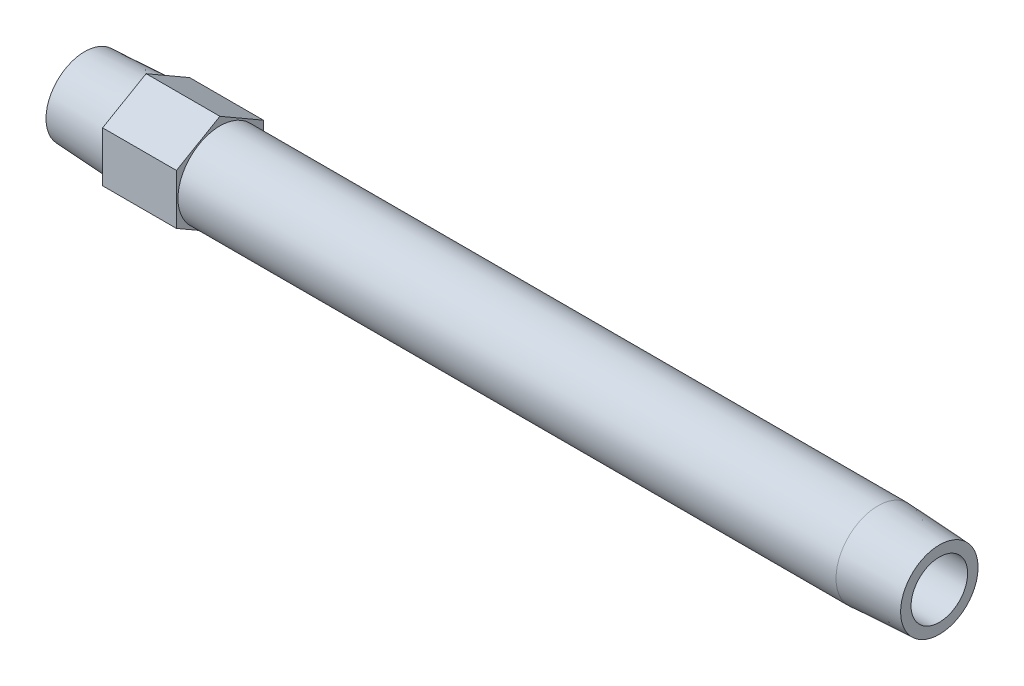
ISO-10303-21;
HEADER;
FILE_DESCRIPTION(('STEP AP214'),'2;1');
FILE_NAME('part.step','',(''),(''),'','','');
FILE_SCHEMA(('AUTOMOTIVE_DESIGN { 1 0 10303 214 1 1 1 1 }'));
ENDSEC;
DATA;
#1=APPLICATION_CONTEXT('core data for automotive mechanical design processes');
#2=APPLICATION_PROTOCOL_DEFINITION('international standard','automotive_design',2000,#1);
#3=PRODUCT_CONTEXT('',#1,'mechanical');
#4=PRODUCT('Part','Part','',(#3));
#5=PRODUCT_RELATED_PRODUCT_CATEGORY('part','',(#4));
#6=PRODUCT_DEFINITION_FORMATION('','',#4);
#7=PRODUCT_DEFINITION_CONTEXT('part definition',#1,'design');
#8=PRODUCT_DEFINITION('design','',#6,#7);
#9=PRODUCT_DEFINITION_SHAPE('','',#8);
#10=(LENGTH_UNIT() NAMED_UNIT(*) SI_UNIT(.MILLI.,.METRE.));
#11=(NAMED_UNIT(*) PLANE_ANGLE_UNIT() SI_UNIT($,.RADIAN.));
#12=(NAMED_UNIT(*) SI_UNIT($,.STERADIAN.) SOLID_ANGLE_UNIT());
#13=UNCERTAINTY_MEASURE_WITH_UNIT(LENGTH_MEASURE(1.E-05),#10,'distance_accuracy_value','');
#14=(GEOMETRIC_REPRESENTATION_CONTEXT(3) GLOBAL_UNCERTAINTY_ASSIGNED_CONTEXT((#13)) GLOBAL_UNIT_ASSIGNED_CONTEXT((#10,
#11,#12)) REPRESENTATION_CONTEXT('',''));
#15=CARTESIAN_POINT('',(0.,0.,0.));
#16=DIRECTION('',(0.,0.,1.));
#17=DIRECTION('',(1.,0.,0.));
#18=AXIS2_PLACEMENT_3D('',#15,#16,#17);
#19=CARTESIAN_POINT('',(0.,0.,-6.3321927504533));
#20=DIRECTION('',(1.,0.,0.));
#21=DIRECTION('',(0.,0.,-1.));
#22=AXIS2_PLACEMENT_3D('',#19,#20,#21);
#23=PLANE('',#22);
#24=CARTESIAN_POINT('',(0.,0.,0.));
#25=DIRECTION('',(-1.,0.,0.));
#26=DIRECTION('',(0.,0.,1.));
#27=AXIS2_PLACEMENT_3D('',#24,#25,#26);
#28=CIRCLE('',#27,6.3321927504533);
#29=CARTESIAN_POINT('',(0.,0.,6.3321927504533));
#30=VERTEX_POINT('',#29);
#31=EDGE_CURVE('E147',#30,#30,#28,.T.);
#32=ORIENTED_EDGE('',*,*,#31,.T.);
#33=EDGE_LOOP('',(#32));
#34=FACE_BOUND('',#33,.T.);
#35=CARTESIAN_POINT('',(0.,0.,0.));
#36=DIRECTION('',(1.,0.,0.));
#37=DIRECTION('',(0.,0.,1.));
#38=AXIS2_PLACEMENT_3D('',#35,#36,#37);
#39=CIRCLE('',#38,4.6228);
#40=CARTESIAN_POINT('',(0.,0.,4.6228));
#41=VERTEX_POINT('',#40);
#42=EDGE_CURVE('E159',#41,#41,#39,.T.);
#43=ORIENTED_EDGE('',*,*,#42,.T.);
#44=EDGE_LOOP('',(#43));
#45=FACE_BOUND('',#44,.T.);
#46=ADVANCED_FACE('F15',(#34,#45),#23,.F.);
#47=CARTESIAN_POINT('',(139.7,0.,-6.33219275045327));
#48=DIRECTION('',(-1.,0.,0.));
#49=DIRECTION('',(0.,0.,1.));
#50=AXIS2_PLACEMENT_3D('',#47,#48,#49);
#51=PLANE('',#50);
#52=CARTESIAN_POINT('',(139.7,0.,0.));
#53=DIRECTION('',(-1.,0.,0.));
#54=DIRECTION('',(0.,0.,1.));
#55=AXIS2_PLACEMENT_3D('',#52,#53,#54);
#56=CIRCLE('',#55,6.33219275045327);
#57=CARTESIAN_POINT('',(139.7,0.,6.33219275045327));
#58=VERTEX_POINT('',#57);
#59=EDGE_CURVE('E150',#58,#58,#56,.T.);
#60=ORIENTED_EDGE('',*,*,#59,.F.);
#61=EDGE_LOOP('',(#60));
#62=FACE_BOUND('',#61,.T.);
#63=CARTESIAN_POINT('',(139.7,0.,0.));
#64=DIRECTION('',(-1.,0.,0.));
#65=DIRECTION('',(0.,0.,1.));
#66=AXIS2_PLACEMENT_3D('',#63,#64,#65);
#67=CIRCLE('',#66,4.6228);
#68=CARTESIAN_POINT('',(139.7,0.,4.6228));
#69=VERTEX_POINT('',#68);
#70=EDGE_CURVE('E156',#69,#69,#67,.F.);
#71=ORIENTED_EDGE('',*,*,#70,.F.);
#72=EDGE_LOOP('',(#71));
#73=FACE_BOUND('',#72,.T.);
#74=ADVANCED_FACE('F178',(#62,#73),#51,.F.);
#75=CARTESIAN_POINT('',(22.098,-12.3183453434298,7.112));
#76=DIRECTION('',(-1.,0.,0.));
#77=DIRECTION('',(0.,-1.,0.));
#78=AXIS2_PLACEMENT_3D('',#75,#76,#77);
#79=PLANE('',#78);
#80=DIRECTION('',(0.,0.5,-0.866025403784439));
#81=VECTOR('',#80,1.);
#82=CARTESIAN_POINT('',(22.098,-8.21223022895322,0.));
#83=LINE('',#82,#81);
#84=CARTESIAN_POINT('',(22.098,-8.21223022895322,0.));
#85=VERTEX_POINT('',#84);
#86=CARTESIAN_POINT('',(22.098,-4.10611511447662,-7.112));
#87=VERTEX_POINT('',#86);
#88=EDGE_CURVE('E103',#85,#87,#83,.T.);
#89=ORIENTED_EDGE('',*,*,#88,.T.);
#90=DIRECTION('',(0.,1.,0.));
#91=VECTOR('',#90,1.);
#92=CARTESIAN_POINT('',(22.098,-4.10611511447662,-7.112));
#93=LINE('',#92,#91);
#94=CARTESIAN_POINT('',(22.098,4.10611511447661,-7.112));
#95=VERTEX_POINT('',#94);
#96=EDGE_CURVE('E83',#87,#95,#93,.T.);
#97=ORIENTED_EDGE('',*,*,#96,.T.);
#98=DIRECTION('',(0.,0.5,0.866025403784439));
#99=VECTOR('',#98,1.);
#100=CARTESIAN_POINT('',(22.098,4.10611511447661,-7.112));
#101=LINE('',#100,#99);
#102=CARTESIAN_POINT('',(22.098,8.21223022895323,0.));
#103=VERTEX_POINT('',#102);
#104=EDGE_CURVE('E102',#95,#103,#101,.T.);
#105=ORIENTED_EDGE('',*,*,#104,.T.);
#106=DIRECTION('',(0.,-0.5,0.866025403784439));
#107=VECTOR('',#106,1.);
#108=CARTESIAN_POINT('',(22.098,8.21223022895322,0.));
#109=LINE('',#108,#107);
#110=CARTESIAN_POINT('',(22.098,4.10611511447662,7.112));
#111=VERTEX_POINT('',#110);
#112=EDGE_CURVE('E105',#103,#111,#109,.T.);
#113=ORIENTED_EDGE('',*,*,#112,.T.);
#114=DIRECTION('',(0.,-1.,0.));
#115=VECTOR('',#114,1.);
#116=CARTESIAN_POINT('',(22.098,4.10611511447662,7.112));
#117=LINE('',#116,#115);
#118=CARTESIAN_POINT('',(22.098,-4.10611511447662,7.112));
#119=VERTEX_POINT('',#118);
#120=EDGE_CURVE('E35',#111,#119,#117,.T.);
#121=ORIENTED_EDGE('',*,*,#120,.T.);
#122=DIRECTION('',(0.,-0.5,-0.866025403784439));
#123=VECTOR('',#122,1.);
#124=CARTESIAN_POINT('',(22.098,-4.10611511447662,7.112));
#125=LINE('',#124,#123);
#126=EDGE_CURVE('E30',#119,#85,#125,.T.);
#127=ORIENTED_EDGE('',*,*,#126,.T.);
#128=EDGE_LOOP('',(#89,#97,#105,#113,#121,#127));
#129=FACE_BOUND('',#128,.T.);
#130=CARTESIAN_POINT('',(22.098,0.,0.));
#131=DIRECTION('',(-1.,0.,0.));
#132=DIRECTION('',(0.,-1.,0.));
#133=AXIS2_PLACEMENT_3D('',#130,#131,#132);
#134=CIRCLE('',#133,6.858);
#135=CARTESIAN_POINT('',(22.098,-6.858,0.));
#136=VERTEX_POINT('',#135);
#137=EDGE_CURVE('E89',#136,#136,#134,.F.);
#138=ORIENTED_EDGE('',*,*,#137,.F.);
#139=EDGE_LOOP('',(#138));
#140=FACE_BOUND('',#139,.T.);
#141=ADVANCED_FACE('F124',(#129,#140),#79,.F.);
#142=CARTESIAN_POINT('',(10.033,-12.3183453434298,7.112));
#143=DIRECTION('',(-1.,0.,0.));
#144=DIRECTION('',(0.,-1.,0.));
#145=AXIS2_PLACEMENT_3D('',#142,#143,#144);
#146=PLANE('',#145);
#147=DIRECTION('',(0.,0.5,-0.866025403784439));
#148=VECTOR('',#147,1.);
#149=CARTESIAN_POINT('',(10.033,-8.21223022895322,0.));
#150=LINE('',#149,#148);
#151=CARTESIAN_POINT('',(10.033,-8.21223022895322,0.));
#152=VERTEX_POINT('',#151);
#153=CARTESIAN_POINT('',(10.033,-4.10611511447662,-7.112));
#154=VERTEX_POINT('',#153);
#155=EDGE_CURVE('E73',#152,#154,#150,.T.);
#156=ORIENTED_EDGE('',*,*,#155,.F.);
#157=DIRECTION('',(0.,-0.5,-0.866025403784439));
#158=VECTOR('',#157,1.);
#159=CARTESIAN_POINT('',(10.033,-4.10611511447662,7.112));
#160=LINE('',#159,#158);
#161=CARTESIAN_POINT('',(10.033,-4.10611511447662,7.112));
#162=VERTEX_POINT('',#161);
#163=EDGE_CURVE('E99',#162,#152,#160,.T.);
#164=ORIENTED_EDGE('',*,*,#163,.F.);
#165=DIRECTION('',(0.,-1.,0.));
#166=VECTOR('',#165,1.);
#167=CARTESIAN_POINT('',(10.033,4.10611511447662,7.112));
#168=LINE('',#167,#166);
#169=CARTESIAN_POINT('',(10.033,4.10611511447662,7.112));
#170=VERTEX_POINT('',#169);
#171=EDGE_CURVE('E133',#170,#162,#168,.T.);
#172=ORIENTED_EDGE('',*,*,#171,.F.);
#173=DIRECTION('',(0.,-0.5,0.866025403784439));
#174=VECTOR('',#173,1.);
#175=CARTESIAN_POINT('',(10.033,8.21223022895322,0.));
#176=LINE('',#175,#174);
#177=CARTESIAN_POINT('',(10.033,8.21223022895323,0.));
#178=VERTEX_POINT('',#177);
#179=EDGE_CURVE('E129',#178,#170,#176,.T.);
#180=ORIENTED_EDGE('',*,*,#179,.F.);
#181=DIRECTION('',(0.,0.5,0.866025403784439));
#182=VECTOR('',#181,1.);
#183=CARTESIAN_POINT('',(10.033,4.10611511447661,-7.112));
#184=LINE('',#183,#182);
#185=CARTESIAN_POINT('',(10.033,4.10611511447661,-7.112));
#186=VERTEX_POINT('',#185);
#187=EDGE_CURVE('E75',#186,#178,#184,.T.);
#188=ORIENTED_EDGE('',*,*,#187,.F.);
#189=DIRECTION('',(0.,1.,0.));
#190=VECTOR('',#189,1.);
#191=CARTESIAN_POINT('',(10.033,-4.10611511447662,-7.112));
#192=LINE('',#191,#190);
#193=EDGE_CURVE('E68',#154,#186,#192,.T.);
#194=ORIENTED_EDGE('',*,*,#193,.F.);
#195=EDGE_LOOP('',(#156,#164,#172,#180,#188,#194));
#196=FACE_BOUND('',#195,.T.);
#197=CARTESIAN_POINT('',(10.033,0.,0.));
#198=DIRECTION('',(-1.,0.,0.));
#199=DIRECTION('',(0.,0.,1.));
#200=AXIS2_PLACEMENT_3D('',#197,#198,#199);
#201=CIRCLE('',#200,6.858);
#202=CARTESIAN_POINT('',(10.033,0.,6.858));
#203=VERTEX_POINT('',#202);
#204=EDGE_CURVE('E95',#203,#203,#201,.T.);
#205=ORIENTED_EDGE('',*,*,#204,.F.);
#206=EDGE_LOOP('',(#205));
#207=FACE_BOUND('',#206,.T.);
#208=ADVANCED_FACE('F69',(#196,#207),#146,.T.);
#209=CARTESIAN_POINT('',(22.098,-8.21223022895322,0.));
#210=DIRECTION('',(0.,0.866025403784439,0.5));
#211=DIRECTION('',(0.,-0.5,0.866025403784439));
#212=AXIS2_PLACEMENT_3D('',#209,#210,#211);
#213=PLANE('',#212);
#214=ORIENTED_EDGE('',*,*,#155,.T.);
#215=DIRECTION('',(-1.,0.,0.));
#216=VECTOR('',#215,1.);
#217=CARTESIAN_POINT('',(22.098,-4.10611511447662,-7.112));
#218=LINE('',#217,#216);
#219=EDGE_CURVE('E10',#87,#154,#218,.T.);
#220=ORIENTED_EDGE('',*,*,#219,.F.);
#221=ORIENTED_EDGE('',*,*,#88,.F.);
#222=DIRECTION('',(-1.,0.,0.));
#223=VECTOR('',#222,1.);
#224=CARTESIAN_POINT('',(22.098,-8.21223022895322,0.));
#225=LINE('',#224,#223);
#226=EDGE_CURVE('E87',#85,#152,#225,.T.);
#227=ORIENTED_EDGE('',*,*,#226,.T.);
#228=EDGE_LOOP('',(#214,#220,#221,#227));
#229=FACE_BOUND('',#228,.T.);
#230=ADVANCED_FACE('F17',(#229),#213,.F.);
#231=CARTESIAN_POINT('',(22.098,-4.10611511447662,-7.112));
#232=DIRECTION('',(0.,0.,1.));
#233=DIRECTION('',(0.,-1.,0.));
#234=AXIS2_PLACEMENT_3D('',#231,#232,#233);
#235=PLANE('',#234);
#236=ORIENTED_EDGE('',*,*,#193,.T.);
#237=DIRECTION('',(-1.,0.,0.));
#238=VECTOR('',#237,1.);
#239=CARTESIAN_POINT('',(22.098,4.10611511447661,-7.112));
#240=LINE('',#239,#238);
#241=EDGE_CURVE('E23',#95,#186,#240,.T.);
#242=ORIENTED_EDGE('',*,*,#241,.F.);
#243=ORIENTED_EDGE('',*,*,#96,.F.);
#244=ORIENTED_EDGE('',*,*,#219,.T.);
#245=EDGE_LOOP('',(#236,#242,#243,#244));
#246=FACE_BOUND('',#245,.T.);
#247=ADVANCED_FACE('F82',(#246),#235,.F.);
#248=CARTESIAN_POINT('',(22.098,4.10611511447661,-7.112));
#249=DIRECTION('',(0.,-0.866025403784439,0.5));
#250=DIRECTION('',(0.,-0.5,-0.866025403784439));
#251=AXIS2_PLACEMENT_3D('',#248,#249,#250);
#252=PLANE('',#251);
#253=ORIENTED_EDGE('',*,*,#187,.T.);
#254=DIRECTION('',(-1.,0.,0.));
#255=VECTOR('',#254,1.);
#256=CARTESIAN_POINT('',(22.098,8.21223022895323,0.));
#257=LINE('',#256,#255);
#258=EDGE_CURVE('E117',#103,#178,#257,.T.);
#259=ORIENTED_EDGE('',*,*,#258,.F.);
#260=ORIENTED_EDGE('',*,*,#104,.F.);
#261=ORIENTED_EDGE('',*,*,#241,.T.);
#262=EDGE_LOOP('',(#253,#259,#260,#261));
#263=FACE_BOUND('',#262,.T.);
#264=ADVANCED_FACE('F121',(#263),#252,.F.);
#265=CARTESIAN_POINT('',(22.098,8.21223022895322,0.));
#266=DIRECTION('',(0.,-0.866025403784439,-0.5));
#267=DIRECTION('',(0.,0.5,-0.866025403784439));
#268=AXIS2_PLACEMENT_3D('',#265,#266,#267);
#269=PLANE('',#268);
#270=ORIENTED_EDGE('',*,*,#179,.T.);
#271=DIRECTION('',(-1.,0.,0.));
#272=VECTOR('',#271,1.);
#273=CARTESIAN_POINT('',(22.098,4.10611511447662,7.112));
#274=LINE('',#273,#272);
#275=EDGE_CURVE('E114',#111,#170,#274,.T.);
#276=ORIENTED_EDGE('',*,*,#275,.F.);
#277=ORIENTED_EDGE('',*,*,#112,.F.);
#278=ORIENTED_EDGE('',*,*,#258,.T.);
#279=EDGE_LOOP('',(#270,#276,#277,#278));
#280=FACE_BOUND('',#279,.T.);
#281=ADVANCED_FACE('F128',(#280),#269,.F.);
#282=CARTESIAN_POINT('',(22.098,4.10611511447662,7.112));
#283=DIRECTION('',(0.,0.,-1.));
#284=DIRECTION('',(-1.,0.,0.));
#285=AXIS2_PLACEMENT_3D('',#282,#283,#284);
#286=PLANE('',#285);
#287=ORIENTED_EDGE('',*,*,#171,.T.);
#288=DIRECTION('',(-1.,0.,0.));
#289=VECTOR('',#288,1.);
#290=CARTESIAN_POINT('',(22.098,-4.10611511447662,7.112));
#291=LINE('',#290,#289);
#292=EDGE_CURVE('E111',#119,#162,#291,.T.);
#293=ORIENTED_EDGE('',*,*,#292,.F.);
#294=ORIENTED_EDGE('',*,*,#120,.F.);
#295=ORIENTED_EDGE('',*,*,#275,.T.);
#296=EDGE_LOOP('',(#287,#293,#294,#295));
#297=FACE_BOUND('',#296,.T.);
#298=ADVANCED_FACE('F132',(#297),#286,.F.);
#299=CARTESIAN_POINT('',(22.098,-4.10611511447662,7.112));
#300=DIRECTION('',(0.,0.866025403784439,-0.5));
#301=DIRECTION('',(0.,0.5,0.866025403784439));
#302=AXIS2_PLACEMENT_3D('',#299,#300,#301);
#303=PLANE('',#302);
#304=ORIENTED_EDGE('',*,*,#163,.T.);
#305=ORIENTED_EDGE('',*,*,#226,.F.);
#306=ORIENTED_EDGE('',*,*,#126,.F.);
#307=ORIENTED_EDGE('',*,*,#292,.T.);
#308=EDGE_LOOP('',(#304,#305,#306,#307));
#309=FACE_BOUND('',#308,.T.);
#310=ADVANCED_FACE('F135',(#309),#303,.F.);
#311=CARTESIAN_POINT('',(10.033,0.,0.));
#312=DIRECTION('',(1.,0.,0.));
#313=DIRECTION('',(0.,0.,-1.));
#314=AXIS2_PLACEMENT_3D('',#311,#312,#313);
#315=CONICAL_SURFACE('',#314,6.858,0.0523598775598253);
#316=ORIENTED_EDGE('',*,*,#31,.F.);
#317=EDGE_LOOP('',(#316));
#318=FACE_BOUND('',#317,.T.);
#319=ORIENTED_EDGE('',*,*,#204,.T.);
#320=EDGE_LOOP('',(#319));
#321=FACE_BOUND('',#320,.T.);
#322=ADVANCED_FACE('F187',(#318,#321),#315,.T.);
#323=CARTESIAN_POINT('',(-60.,0.,0.));
#324=DIRECTION('',(-1.,0.,0.));
#325=DIRECTION('',(0.,0.,1.));
#326=AXIS2_PLACEMENT_3D('',#323,#324,#325);
#327=CYLINDRICAL_SURFACE('',#326,6.858);
#328=ORIENTED_EDGE('',*,*,#137,.T.);
#329=EDGE_LOOP('',(#328));
#330=FACE_BOUND('',#329,.T.);
#331=CARTESIAN_POINT('',(129.667,0.,0.));
#332=DIRECTION('',(-1.,0.,0.));
#333=DIRECTION('',(0.,0.,1.));
#334=AXIS2_PLACEMENT_3D('',#331,#332,#333);
#335=CIRCLE('',#334,6.858);
#336=CARTESIAN_POINT('',(129.667,0.,6.858));
#337=VERTEX_POINT('',#336);
#338=EDGE_CURVE('E153',#337,#337,#335,.T.);
#339=ORIENTED_EDGE('',*,*,#338,.T.);
#340=EDGE_LOOP('',(#339));
#341=FACE_BOUND('',#340,.T.);
#342=ADVANCED_FACE('F174',(#330,#341),#327,.T.);
#343=CARTESIAN_POINT('',(139.7,0.,0.));
#344=DIRECTION('',(-1.,0.,0.));
#345=DIRECTION('',(0.,0.,1.));
#346=AXIS2_PLACEMENT_3D('',#343,#344,#345);
#347=CONICAL_SURFACE('',#346,6.33219275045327,0.052359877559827);
#348=ORIENTED_EDGE('',*,*,#338,.F.);
#349=EDGE_LOOP('',(#348));
#350=FACE_BOUND('',#349,.T.);
#351=ORIENTED_EDGE('',*,*,#59,.T.);
#352=EDGE_LOOP('',(#351));
#353=FACE_BOUND('',#352,.T.);
#354=ADVANCED_FACE('F167',(#350,#353),#347,.T.);
#355=CARTESIAN_POINT('',(141.379542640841,0.,0.));
#356=DIRECTION('',(-1.,0.,0.));
#357=DIRECTION('',(0.,0.,1.));
#358=AXIS2_PLACEMENT_3D('',#355,#356,#357);
#359=CYLINDRICAL_SURFACE('',#358,4.6228);
#360=ORIENTED_EDGE('',*,*,#70,.T.);
#361=EDGE_LOOP('',(#360));
#362=FACE_BOUND('',#361,.T.);
#363=ORIENTED_EDGE('',*,*,#42,.F.);
#364=EDGE_LOOP('',(#363));
#365=FACE_BOUND('',#364,.T.);
#366=ADVANCED_FACE('F165',(#362,#365),#359,.F.);
#367=CLOSED_SHELL('',(#46,#74,#141,#208,#230,#247,#264,#281,#298,#310,#322,#342,#354,#366));
#368=MANIFOLD_SOLID_BREP('B1',#367);
#369=ADVANCED_BREP_SHAPE_REPRESENTATION('',(#18,#368),#14);
#370=SHAPE_DEFINITION_REPRESENTATION(#9,#369);
ENDSEC;
END-ISO-10303-21;
